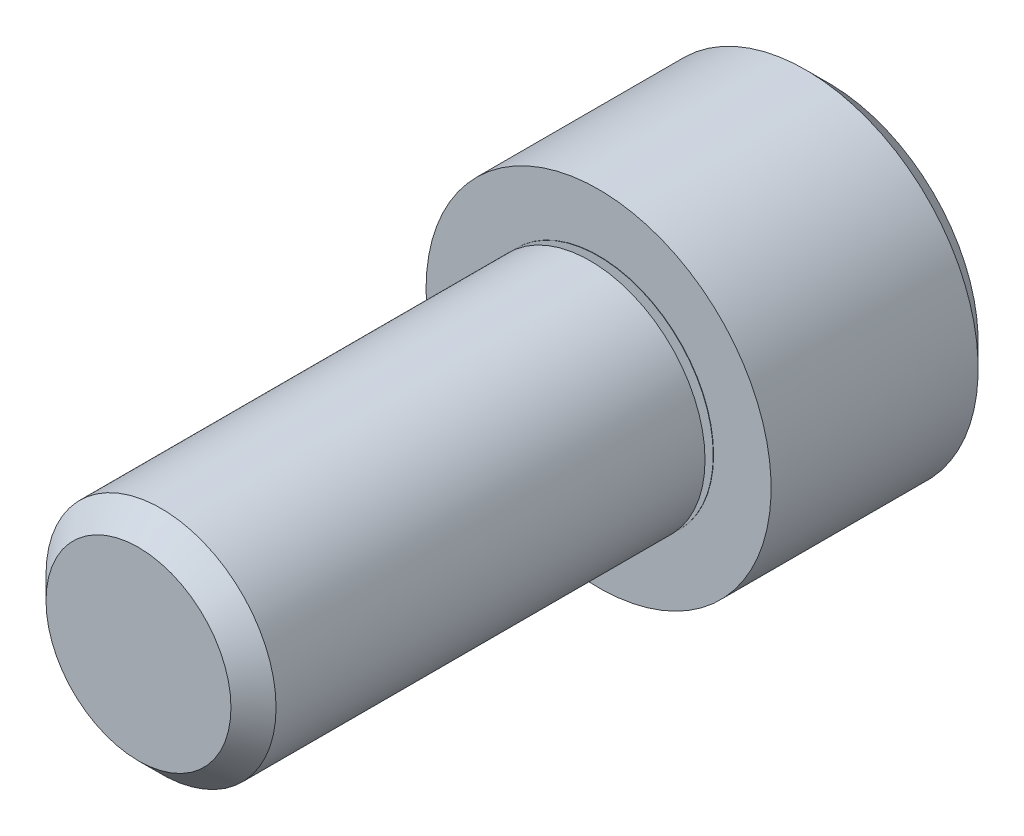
from build123d import *

# Parameters (mm, degrees)
CUT_EXTRUDE1_DEPTH = 3.175


with BuildPart() as part:
    # Logo3_bib1 → Revolve1 (revolve)
    with BuildSketch(Plane(origin=(0, 0, 0), x_dir=(-1, 0, 0), z_dir=(0, -1, 0))):
        with BuildLine():
            Line((0, -12.7), (0, 6.35))
            Line((0, 6.35), (4.1275, 6.35))
            Line((4.1275, 6.35), (4.7625, 5.715))
            Line((4.7625, 5.715), (4.7625, 0))
            Line((4.7625, 0), (3.175, 0))
            Line((3.175, 0), (3.175, -0.01))
            Line((3.175, -0.01), (2.666125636, -0.01))
            ThreePointArc((2.666125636, -0.01), (2.646429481, -0.026527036), (2.659285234, -0.048793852))
            Line((2.659285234, -0.048793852), (3.175, -0.236498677))
            Line((3.175, -0.236498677), (3.175, -12.0777))
            Line((3.175, -12.0777), (2.5527, -12.7))
            Line((2.5527, -12.7), (0, -12.7))
        make_face()
    revolve(axis=Axis((0, 0, -10.585154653), (0, 0, 1)))

    # Logo3_bib2 → Cut-Extrude1 (cut)
    with BuildSketch(Plane(origin=(0, 0, -6.35), x_dir=(1, 0, 0), z_dir=(0, 0, -1))):
        Polygon((2.749630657, 0), (1.374815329, 2.38125), (-1.374815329, 2.38125), (-2.749630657, 0), (-1.374815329, -2.38125), (1.374815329, -2.38125), align=None)
    extrude(amount=-CUT_EXTRUDE1_DEPTH, mode=Mode.SUBTRACT)


solid = part.part
